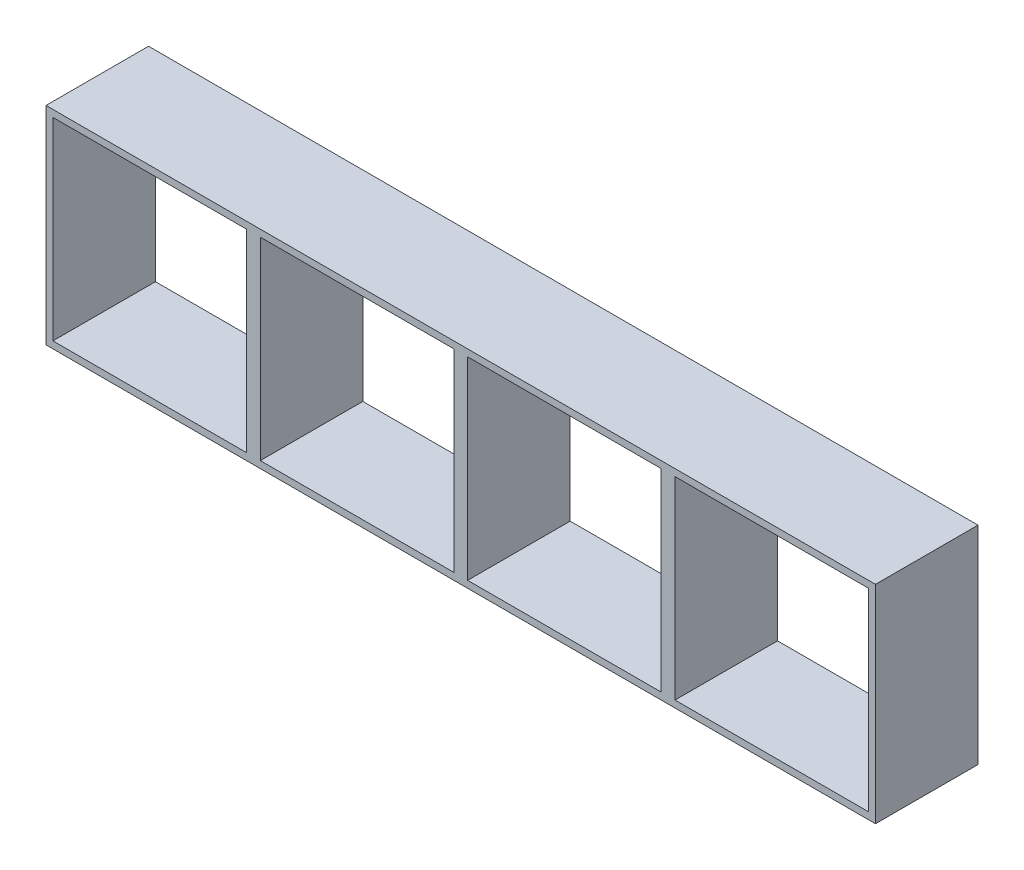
from build123d import *

# Parameters (mm, degrees)
ESQUISSE1_W        = 120
ESQUISSE1_H        = 30
ESQUISSE1_W_2      = 28
ESQUISSE1_H_2      = 28
BOSS_EXTRU_1_DEPTH = 14.833333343


with BuildPart() as part:
    # Esquisse1 → Boss.-Extru.1 (new body)
    with BuildSketch(Plane.XY):
        with Locations((60, 15)):
            Rectangle(ESQUISSE1_W, ESQUISSE1_H)
        with Locations((45, 15)):
            Rectangle(ESQUISSE1_W_2, ESQUISSE1_H_2, mode=Mode.SUBTRACT)
        with Locations((75, 15)):
            Rectangle(ESQUISSE1_W_2, ESQUISSE1_H_2, mode=Mode.SUBTRACT)
        with Locations((105, 15)):
            Rectangle(ESQUISSE1_W_2, ESQUISSE1_H_2, mode=Mode.SUBTRACT)
        with Locations((15, 15)):
            Rectangle(ESQUISSE1_W_2, ESQUISSE1_H_2, mode=Mode.SUBTRACT)
    extrude(amount=BOSS_EXTRU_1_DEPTH)


solid = part.part
